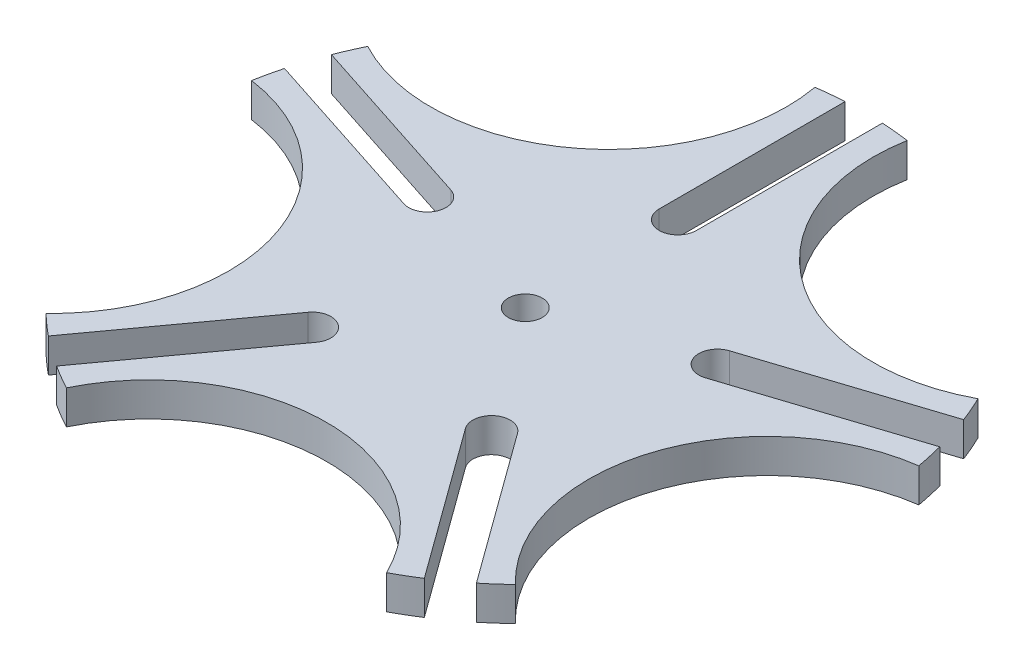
from build123d import *

# Parameters (mm, degrees)
SKETCH1_R           = 5
BOSS_EXTRUDE1_DEPTH = 10


with BuildPart() as part:
    # Sketch1 → Boss-Extrude1 (new body)
    with BuildSketch(Plane(origin=(0, 0, 0), x_dir=(1, 0, 0), z_dir=(0, 1, 0))):
        with BuildLine():
            Line((41.097949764, 19.136575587), (93.262101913, 36.085736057))
            ThreePointArc((93.262101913, 36.085736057), (91.716917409, 39.849806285), (90.019888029, 43.547901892))
            ThreePointArc((90.019888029, 43.547901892), (34.424916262, 47.381832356), (13.598840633, 99.07104286))
            ThreePointArc((13.598840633, 99.07104286), (9.55733179, 99.542239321), (5.5, 99.848635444))
            Line((5.5, 99.848635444), (5.5, 45))
            ThreePointArc((5.5, 45), (0, 39.5), (-5.5, 45))
            Line((-5.5, 45), (-5.5, 99.848635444))
            ThreePointArc((-5.5, 99.848635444), (-9.55733179, 99.542239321), (-13.598840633, 99.07104286))
            ThreePointArc((-13.598840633, 99.07104286), (-34.424916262, 47.381832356), (-90.019888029, 43.547901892))
            ThreePointArc((-90.019888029, 43.547901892), (-91.716917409, 39.849806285), (-93.262101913, 36.085736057))
            Line((-93.262101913, 36.085736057), (-41.097949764, 19.136575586))
            ThreePointArc((-41.097949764, 19.136575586), (-37.566732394, 12.206171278), (-44.497136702, 8.674953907))
            Line((-44.497136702, 8.674953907), (-96.661288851, 25.624114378))
            ThreePointArc((-96.661288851, 25.624114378), (-97.623673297, 21.670680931), (-98.424433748, 17.681369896))
            ThreePointArc((-98.424433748, 17.681369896), (-55.700684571, -18.098249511), (-69.234191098, -72.156959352))
            ThreePointArc((-69.234191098, -72.156959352), (-66.241504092, -74.913704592), (-63.139148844, -77.546424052))
            Line((-63.139148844, -77.546424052), (-30.899929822, -33.172945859))
            ThreePointArc((-30.899929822, -33.172945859), (-23.217517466, -31.956171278), (-22.000742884, -39.638583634))
            Line((-22.000742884, -39.638583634), (-54.239961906, -84.012061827))
            ThreePointArc((-54.239961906, -84.012061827), (-50.777416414, -86.149021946), (-47.230804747, -88.143355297))
            ThreePointArc((-47.230804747, -88.143355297), (0, -58.567165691), (47.230804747, -88.143355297))
            ThreePointArc((47.230804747, -88.143355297), (50.777416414, -86.149021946), (54.239961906, -84.012061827))
            Line((54.239961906, -84.012061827), (22.000742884, -39.638583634))
            ThreePointArc((22.000742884, -39.638583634), (23.217517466, -31.956171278), (30.899929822, -33.172945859))
            Line((30.899929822, -33.172945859), (63.139148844, -77.546424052))
            ThreePointArc((63.139148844, -77.546424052), (66.241504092, -74.913704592), (69.234191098, -72.156959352))
            ThreePointArc((69.234191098, -72.156959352), (55.700684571, -18.098249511), (98.424433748, 17.681369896))
            ThreePointArc((98.424433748, 17.681369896), (97.623673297, 21.670680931), (96.661288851, 25.624114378))
            Line((96.661288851, 25.624114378), (44.497136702, 8.674953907))
            ThreePointArc((44.497136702, 8.674953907), (37.566732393, 12.206171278), (41.097949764, 19.136575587))
        make_face()
        with Locations(Location((0, 0, 0), (0, 0, 270))):
            Circle(SKETCH1_R, mode=Mode.SUBTRACT)
    extrude(amount=BOSS_EXTRUDE1_DEPTH)


solid = part.part
